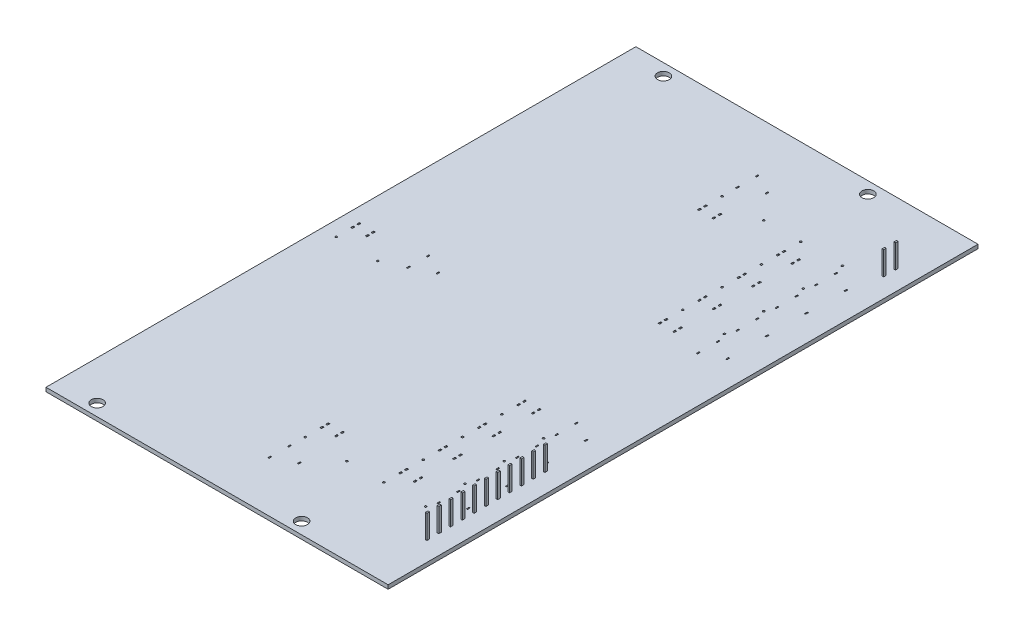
from build123d import *

# Parameters (mm, degrees)
BOSS_EXTRUDE1_DEPTH = 1
SKETCH3_R           = 0.25
SKETCH3_W           = 0.4
SKETCH3_H           = 0.65
SKETCH3_W_2         = 0.3
SKETCH3_H_2         = 0.7
CUT_EXTRUDE1_DEPTH  = 1
SKETCH6_R           = 0.25
SKETCH6_W           = 0.4
SKETCH6_H           = 0.65
SKETCH6_W_2         = 0.3
SKETCH6_H_2         = 0.7
CUT_EXTRUDE3_DEPTH  = 1
SKETCH7_R           = 1.5
CUT_EXTRUDE4_DEPTH  = 1
SKETCH9_W           = 0.4
SKETCH9_H           = 0.65
BOSS_EXTRUDE2_DEPTH = 7


with BuildPart() as part:
    # Sketch1 → Boss-Extrude1 (new body)
    with BuildSketch(Plane(origin=(0, 0, 0), x_dir=(1, 0, 0), z_dir=(0, 1, 0))):
        Polygon((-25, -75), (25, -75), (25, 75), (-25, 75), (-62, 75), (-62, -75), align=None)
    extrude(amount=BOSS_EXTRUDE1_DEPTH)

    # Sketch3 → Cut-Extrude1 (cut)
    with BuildSketch(Plane.XZ):
        with Locations(Location((1.925434, -23, 0), (0, 0, 270))):
            Circle(SKETCH3_R)
        with Locations(Location((12.525434, -23, 0), (0, 0, 270))):
            Circle(SKETCH3_R)
        with Locations(Location((1.925434, 33, 0), (0, 0, 270))):
            Circle(SKETCH3_R)
        with Locations(Location((12.525434, 33, 0), (0, 0, 270))):
            Circle(SKETCH3_R)
        with Locations(Location((1.925434, -33, 0), (0, 0, 270))):
            Circle(SKETCH3_R)
        with Locations(Location((12.525434, -33, 0), (0, 0, 270))):
            Circle(SKETCH3_R)
        with Locations(Location((1.925434, 23, 0), (0, 0, 270))):
            Circle(SKETCH3_R)
        with Locations(Location((12.525434, 23, 0), (0, 0, 270))):
            Circle(SKETCH3_R)
        with Locations(Location((1.925434, 43, 0), (0, 0, 270))):
            Circle(SKETCH3_R)
        with Locations(Location((12.525434, 43, 0), (0, 0, 270))):
            Circle(SKETCH3_R)
        with Locations(Location((1.925434, -43, 0), (0, 0, 270))):
            Circle(SKETCH3_R)
        with Locations(Location((12.525434, -43, 0), (0, 0, 270))):
            Circle(SKETCH3_R)
        with Locations(Location((-18.074566, -53, 0), (0, 0, 270))):
            Circle(SKETCH3_R)
        with Locations(Location((-7.474566, -53, 0), (0, 0, 270))):
            Circle(SKETCH3_R)
        with Locations(Location((1.925434, 53, 0), (0, 0, 270))):
            Circle(SKETCH3_R)
        with Locations(Location((12.525434, 53, 0), (0, 0, 270))):
            Circle(SKETCH3_R)
        with Locations(Location((-18.074566, 53, 0), (0, 0, 270))):
            Circle(SKETCH3_R)
        with Locations(Location((-7.474566, 53, 0), (0, 0, 270))):
            Circle(SKETCH3_R)
        with Locations(Location((1.925434, -53, 0), (0, 0, 270))):
            Circle(SKETCH3_R)
        with Locations(Location((12.525434, -53, 0), (0, 0, 270))):
            Circle(SKETCH3_R)
        with Locations((1.925434, -17.25)):
            Rectangle(SKETCH3_W, SKETCH3_H)
        with Locations((5.625434, -17.25)):
            Rectangle(SKETCH3_W, SKETCH3_H)
        with Locations((5.625434, -18.75)):
            Rectangle(SKETCH3_W, SKETCH3_H)
        with Locations((1.925434, -18.75)):
            Rectangle(SKETCH3_W, SKETCH3_H)
        with Locations((5.625434, 17.25)):
            Rectangle(SKETCH3_W, SKETCH3_H)
        with Locations((1.925434, 17.25)):
            Rectangle(SKETCH3_W, SKETCH3_H)
        with Locations((5.625434, 18.75)):
            Rectangle(SKETCH3_W, SKETCH3_H)
        with Locations((1.925434, 18.75)):
            Rectangle(SKETCH3_W, SKETCH3_H)
        with Locations((1.925434, 28.75)):
            Rectangle(SKETCH3_W, SKETCH3_H)
        with Locations((1.925434, 27.25)):
            Rectangle(SKETCH3_W, SKETCH3_H)
        with Locations((5.625434, 27.25)):
            Rectangle(SKETCH3_W, SKETCH3_H)
        with Locations((5.625434, 28.75)):
            Rectangle(SKETCH3_W, SKETCH3_H)
        with Locations((1.925434, 38.75)):
            Rectangle(SKETCH3_W, SKETCH3_H)
        with Locations((1.925434, 37.25)):
            Rectangle(SKETCH3_W, SKETCH3_H)
        with Locations((5.625434, 37.25)):
            Rectangle(SKETCH3_W, SKETCH3_H)
        with Locations((5.625434, 38.75)):
            Rectangle(SKETCH3_W, SKETCH3_H)
        with Locations((1.925434, 48.75)):
            Rectangle(SKETCH3_W, SKETCH3_H)
        with Locations((1.925434, 47.25)):
            Rectangle(SKETCH3_W, SKETCH3_H)
        with Locations((5.625434, 47.25)):
            Rectangle(SKETCH3_W, SKETCH3_H)
        with Locations((5.625434, 48.75)):
            Rectangle(SKETCH3_W, SKETCH3_H)
        with Locations((1.925434, -27.25)):
            Rectangle(SKETCH3_W, SKETCH3_H)
        with Locations((1.925434, -28.75)):
            Rectangle(SKETCH3_W, SKETCH3_H)
        with Locations((5.625434, -27.25)):
            Rectangle(SKETCH3_W, SKETCH3_H)
        with Locations((5.625434, -28.75)):
            Rectangle(SKETCH3_W, SKETCH3_H)
        with Locations((1.925434, -37.25)):
            Rectangle(SKETCH3_W, SKETCH3_H)
        with Locations((1.925434, -38.75)):
            Rectangle(SKETCH3_W, SKETCH3_H)
        with Locations((5.625434, -37.25)):
            Rectangle(SKETCH3_W, SKETCH3_H)
        with Locations((5.625434, -38.75)):
            Rectangle(SKETCH3_W, SKETCH3_H)
        with Locations((1.925434, -47.25)):
            Rectangle(SKETCH3_W, SKETCH3_H)
        with Locations((1.925434, -48.75)):
            Rectangle(SKETCH3_W, SKETCH3_H)
        with Locations((5.625434, -47.25)):
            Rectangle(SKETCH3_W, SKETCH3_H)
        with Locations((5.625434, -48.75)):
            Rectangle(SKETCH3_W, SKETCH3_H)
        with Locations((13.367157, 30.5)):
            Rectangle(SKETCH3_W_2, SKETCH3_H_2)
        with Locations((18.367157, 18)):
            Rectangle(SKETCH3_W_2, SKETCH3_H_2)
        with Locations((-18.074566, 47.25)):
            Rectangle(SKETCH3_W, SKETCH3_H)
        with Locations((-18.074566, 48.75)):
            Rectangle(SKETCH3_W, SKETCH3_H)
        with Locations((-14.374566, 47.25)):
            Rectangle(SKETCH3_W, SKETCH3_H)
        with Locations((-14.374566, 48.75)):
            Rectangle(SKETCH3_W, SKETCH3_H)
        with Locations((-18.074566, -48.75)):
            Rectangle(SKETCH3_W, SKETCH3_H)
        with Locations((-18.074566, -47.25)):
            Rectangle(SKETCH3_W, SKETCH3_H)
        with Locations((-14.374566, -47.25)):
            Rectangle(SKETCH3_W, SKETCH3_H)
        with Locations((-14.374566, -48.75)):
            Rectangle(SKETCH3_W, SKETCH3_H)
        with Locations((13.367157, 15.5)):
            Rectangle(SKETCH3_W_2, SKETCH3_H_2)
        with Locations((13.367157, 20.5)):
            Rectangle(SKETCH3_W_2, SKETCH3_H_2)
        with Locations((18.367157, 28)):
            Rectangle(SKETCH3_W_2, SKETCH3_H_2)
        with Locations((13.367157, 25.5)):
            Rectangle(SKETCH3_W_2, SKETCH3_H_2)
        with Locations((13.367157, 40.5)):
            Rectangle(SKETCH3_W_2, SKETCH3_H_2)
        with Locations((18.367157, 38)):
            Rectangle(SKETCH3_W_2, SKETCH3_H_2)
        with Locations((13.367157, 35.5)):
            Rectangle(SKETCH3_W_2, SKETCH3_H_2)
        with Locations((13.367157, 50.5)):
            Rectangle(SKETCH3_W_2, SKETCH3_H_2)
        with Locations((18.367157, 48)):
            Rectangle(SKETCH3_W_2, SKETCH3_H_2)
        with Locations((13.367157, 45.5)):
            Rectangle(SKETCH3_W_2, SKETCH3_H_2)
        with Locations((18.367157, -18)):
            Rectangle(SKETCH3_W_2, SKETCH3_H_2)
        with Locations((13.367157, -15.5)):
            Rectangle(SKETCH3_W_2, SKETCH3_H_2)
        with Locations((13.367157, -20.5)):
            Rectangle(SKETCH3_W_2, SKETCH3_H_2)
        with Locations((13.367157, -25.5)):
            Rectangle(SKETCH3_W_2, SKETCH3_H_2)
        with Locations((13.367157, -30.5)):
            Rectangle(SKETCH3_W_2, SKETCH3_H_2)
        with Locations((18.367157, -28)):
            Rectangle(SKETCH3_W_2, SKETCH3_H_2)
        with Locations((13.367157, -35.5)):
            Rectangle(SKETCH3_W_2, SKETCH3_H_2)
        with Locations((13.367157, -40.5)):
            Rectangle(SKETCH3_W_2, SKETCH3_H_2)
        with Locations((18.367157, -38)):
            Rectangle(SKETCH3_W_2, SKETCH3_H_2)
        with Locations((13.367157, -45.5)):
            Rectangle(SKETCH3_W_2, SKETCH3_H_2)
        with Locations((13.367157, -50.5)):
            Rectangle(SKETCH3_W_2, SKETCH3_H_2)
        with Locations((18.367157, -48)):
            Rectangle(SKETCH3_W_2, SKETCH3_H_2)
        with Locations((-18.112545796, 61.957674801)):
            Rectangle(SKETCH3_W_2, SKETCH3_H_2)
        with Locations((-18.112545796, 56.957674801)):
            Rectangle(SKETCH3_W_2, SKETCH3_H_2)
        with Locations((-13.112545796, 59.457674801)):
            Rectangle(SKETCH3_W_2, SKETCH3_H_2)
        with Locations((-18.112545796, -56.957674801)):
            Rectangle(SKETCH3_W_2, SKETCH3_H_2)
        with Locations((-18.112545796, -61.957674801)):
            Rectangle(SKETCH3_W_2, SKETCH3_H_2)
        with Locations((-13.112545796, -59.457674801)):
            Rectangle(SKETCH3_W_2, SKETCH3_H_2)
    extrude(amount=-CUT_EXTRUDE1_DEPTH, mode=Mode.SUBTRACT)

    # Sketch6 → Cut-Extrude3 (cut)
    with BuildSketch(Plane(origin=(0, 1, 0), x_dir=(1, 0, 0), z_dir=(0, 1, 0))):
        with Locations(Location((-58.213528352, -5, 0), (0, 0, 270))):
            Circle(SKETCH6_R)
        with Locations(Location((-47.613528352, -5, 0), (0, 0, 270))):
            Circle(SKETCH6_R)
        with Locations((-54.524566, -0.75)):
            Rectangle(SKETCH6_W, SKETCH6_H)
        with Locations((-58.224566, 0.75)):
            Rectangle(SKETCH6_W, SKETCH6_H)
        with Locations((-54.524566, 0.75)):
            Rectangle(SKETCH6_W, SKETCH6_H)
        with Locations((-58.224566, -0.75)):
            Rectangle(SKETCH6_W, SKETCH6_H)
        with Locations((-37.328308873, 0)):
            Rectangle(SKETCH6_W_2, SKETCH6_H_2)
        with Locations((-42.328308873, -2.5)):
            Rectangle(SKETCH6_W_2, SKETCH6_H_2)
        with Locations((-42.328308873, 2.5)):
            Rectangle(SKETCH6_W_2, SKETCH6_H_2)
    extrude(amount=-CUT_EXTRUDE3_DEPTH, mode=Mode.SUBTRACT)

    # Sketch7 → Cut-Extrude4 (cut)
    with BuildSketch(Plane(origin=(0, 1, 0), x_dir=(1, 0, 0), z_dir=(0, 1, 0))):
        with Locations(Location((0, 72, 0), (0, 0, 270))):
            Circle(SKETCH7_R)
        with Locations(Location((0, -72, 0), (0, 0, 270))):
            Circle(SKETCH7_R)
        with Locations(Location((-52, 72, 0), (0, 0, 270))):
            Circle(SKETCH7_R)
        with Locations(Location((-52, -72, 0), (0, 0, 270))):
            Circle(SKETCH7_R)
    extrude(amount=-CUT_EXTRUDE4_DEPTH, mode=Mode.SUBTRACT)

    # Sketch9 → Boss-Extrude2 (add)
    with BuildSketch(Plane.XZ):
        with Locations((20, 57)):
            Rectangle(SKETCH9_W, SKETCH9_H)
        with Locations((20, 60)):
            Rectangle(SKETCH9_W, SKETCH9_H)
        with Locations((20, 54)):
            Rectangle(SKETCH9_W, SKETCH9_H)
        with Locations((20, 51)):
            Rectangle(SKETCH9_W, SKETCH9_H)
        with Locations((20, 48)):
            Rectangle(SKETCH9_W, SKETCH9_H)
        with Locations((20, 45)):
            Rectangle(SKETCH9_W, SKETCH9_H)
        with Locations((20, 42)):
            Rectangle(SKETCH9_W, SKETCH9_H)
        with Locations((20, 39)):
            Rectangle(SKETCH9_W, SKETCH9_H)
        with Locations((20, 36)):
            Rectangle(SKETCH9_W, SKETCH9_H)
        with Locations((20, 33)):
            Rectangle(SKETCH9_W, SKETCH9_H)
        with Locations((20, 30)):
            Rectangle(SKETCH9_W, SKETCH9_H)
        with Locations((20, -56.127886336)):
            Rectangle(SKETCH9_W, SKETCH9_H)
        with Locations((20, -59.127886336)):
            Rectangle(SKETCH9_W, SKETCH9_H)
    extrude(amount=-BOSS_EXTRUDE2_DEPTH)


solid = part.part
